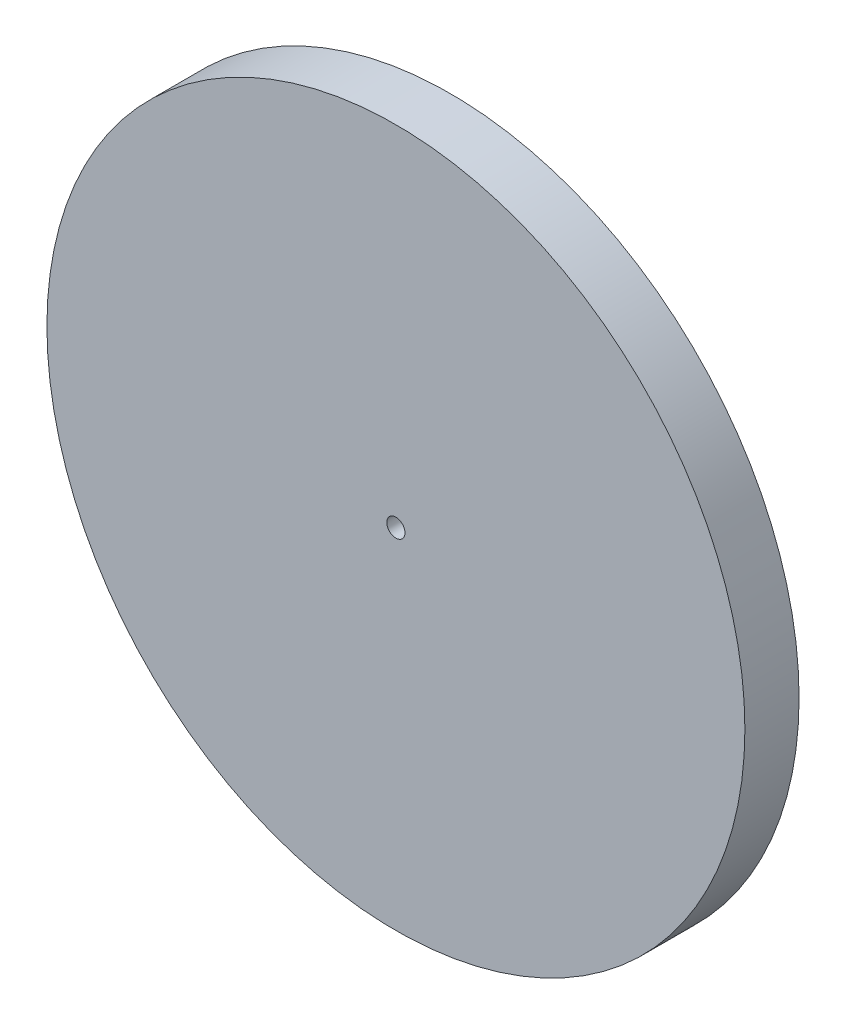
ISO-10303-21;
HEADER;
FILE_DESCRIPTION(('STEP AP214'),'2;1');
FILE_NAME('part.step','',(''),(''),'','','');
FILE_SCHEMA(('AUTOMOTIVE_DESIGN { 1 0 10303 214 1 1 1 1 }'));
ENDSEC;
DATA;
#1=APPLICATION_CONTEXT('core data for automotive mechanical design processes');
#2=APPLICATION_PROTOCOL_DEFINITION('international standard','automotive_design',2000,#1);
#3=PRODUCT_CONTEXT('',#1,'mechanical');
#4=PRODUCT('Part','Part','',(#3));
#5=PRODUCT_RELATED_PRODUCT_CATEGORY('part','',(#4));
#6=PRODUCT_DEFINITION_FORMATION('','',#4);
#7=PRODUCT_DEFINITION_CONTEXT('part definition',#1,'design');
#8=PRODUCT_DEFINITION('design','',#6,#7);
#9=PRODUCT_DEFINITION_SHAPE('','',#8);
#10=(LENGTH_UNIT() NAMED_UNIT(*) SI_UNIT(.MILLI.,.METRE.));
#11=(NAMED_UNIT(*) PLANE_ANGLE_UNIT() SI_UNIT($,.RADIAN.));
#12=(NAMED_UNIT(*) SI_UNIT($,.STERADIAN.) SOLID_ANGLE_UNIT());
#13=UNCERTAINTY_MEASURE_WITH_UNIT(LENGTH_MEASURE(1.E-05),#10,'distance_accuracy_value','');
#14=(GEOMETRIC_REPRESENTATION_CONTEXT(3) GLOBAL_UNCERTAINTY_ASSIGNED_CONTEXT((#13)) GLOBAL_UNIT_ASSIGNED_CONTEXT((#10,
#11,#12)) REPRESENTATION_CONTEXT('',''));
#15=CARTESIAN_POINT('',(0.,0.,0.));
#16=DIRECTION('',(0.,0.,1.));
#17=DIRECTION('',(1.,0.,0.));
#18=AXIS2_PLACEMENT_3D('',#15,#16,#17);
#19=CARTESIAN_POINT('',(0.,0.,-23.622));
#20=DIRECTION('',(0.,0.,1.));
#21=DIRECTION('',(1.,0.,0.));
#22=AXIS2_PLACEMENT_3D('',#19,#20,#21);
#23=CYLINDRICAL_SURFACE('',#22,152.146);
#24=CARTESIAN_POINT('',(0.,0.,-23.622));
#25=DIRECTION('',(0.,0.,1.));
#26=DIRECTION('',(1.,0.,0.));
#27=AXIS2_PLACEMENT_3D('',#24,#25,#26);
#28=CIRCLE('',#27,152.146);
#29=CARTESIAN_POINT('',(152.146,0.,-23.622));
#30=VERTEX_POINT('',#29);
#31=EDGE_CURVE('E10',#30,#30,#28,.T.);
#32=ORIENTED_EDGE('',*,*,#31,.T.);
#33=EDGE_LOOP('',(#32));
#34=FACE_BOUND('',#33,.T.);
#35=CARTESIAN_POINT('',(0.,0.,0.));
#36=DIRECTION('',(0.,0.,1.));
#37=DIRECTION('',(1.,0.,0.));
#38=AXIS2_PLACEMENT_3D('',#35,#36,#37);
#39=CIRCLE('',#38,152.146);
#40=CARTESIAN_POINT('',(152.146,0.,0.));
#41=VERTEX_POINT('',#40);
#42=EDGE_CURVE('E39',#41,#41,#39,.T.);
#43=ORIENTED_EDGE('',*,*,#42,.F.);
#44=EDGE_LOOP('',(#43));
#45=FACE_BOUND('',#44,.T.);
#46=ADVANCED_FACE('F33',(#34,#45),#23,.T.);
#47=CARTESIAN_POINT('',(0.,0.,-23.622));
#48=DIRECTION('',(0.,0.,1.));
#49=DIRECTION('',(1.,0.,0.));
#50=AXIS2_PLACEMENT_3D('',#47,#48,#49);
#51=PLANE('',#50);
#52=CARTESIAN_POINT('',(0.,0.,-23.622));
#53=DIRECTION('',(0.,0.,1.));
#54=DIRECTION('',(1.,0.,0.));
#55=AXIS2_PLACEMENT_3D('',#52,#53,#54);
#56=CIRCLE('',#55,3.9624);
#57=CARTESIAN_POINT('',(3.9624,0.,-23.622));
#58=VERTEX_POINT('',#57);
#59=EDGE_CURVE('E43',#58,#58,#56,.T.);
#60=ORIENTED_EDGE('',*,*,#59,.T.);
#61=EDGE_LOOP('',(#60));
#62=FACE_BOUND('',#61,.T.);
#63=ORIENTED_EDGE('',*,*,#31,.F.);
#64=EDGE_LOOP('',(#63));
#65=FACE_BOUND('',#64,.T.);
#66=ADVANCED_FACE('F57',(#62,#65),#51,.F.);
#67=CARTESIAN_POINT('',(0.,0.,0.));
#68=DIRECTION('',(0.,0.,1.));
#69=DIRECTION('',(1.,0.,0.));
#70=AXIS2_PLACEMENT_3D('',#67,#68,#69);
#71=PLANE('',#70);
#72=CARTESIAN_POINT('',(0.,0.,0.));
#73=DIRECTION('',(0.,0.,1.));
#74=DIRECTION('',(1.,0.,0.));
#75=AXIS2_PLACEMENT_3D('',#72,#73,#74);
#76=CIRCLE('',#75,3.9624);
#77=CARTESIAN_POINT('',(3.9624,0.,0.));
#78=VERTEX_POINT('',#77);
#79=EDGE_CURVE('E47',#78,#78,#76,.T.);
#80=ORIENTED_EDGE('',*,*,#79,.F.);
#81=EDGE_LOOP('',(#80));
#82=FACE_BOUND('',#81,.T.);
#83=ORIENTED_EDGE('',*,*,#42,.T.);
#84=EDGE_LOOP('',(#83));
#85=FACE_BOUND('',#84,.T.);
#86=ADVANCED_FACE('F55',(#82,#85),#71,.T.);
#87=CARTESIAN_POINT('',(0.,0.,-23.622));
#88=DIRECTION('',(0.,0.,1.));
#89=DIRECTION('',(1.,0.,0.));
#90=AXIS2_PLACEMENT_3D('',#87,#88,#89);
#91=CYLINDRICAL_SURFACE('',#90,3.9624);
#92=ORIENTED_EDGE('',*,*,#59,.F.);
#93=EDGE_LOOP('',(#92));
#94=FACE_BOUND('',#93,.T.);
#95=ORIENTED_EDGE('',*,*,#79,.T.);
#96=EDGE_LOOP('',(#95));
#97=FACE_BOUND('',#96,.T.);
#98=ADVANCED_FACE('F53',(#94,#97),#91,.F.);
#99=CLOSED_SHELL('',(#46,#66,#86,#98));
#100=MANIFOLD_SOLID_BREP('B2',#99);
#101=ADVANCED_BREP_SHAPE_REPRESENTATION('',(#18,#100),#14);
#102=SHAPE_DEFINITION_REPRESENTATION(#9,#101);
ENDSEC;
END-ISO-10303-21;
